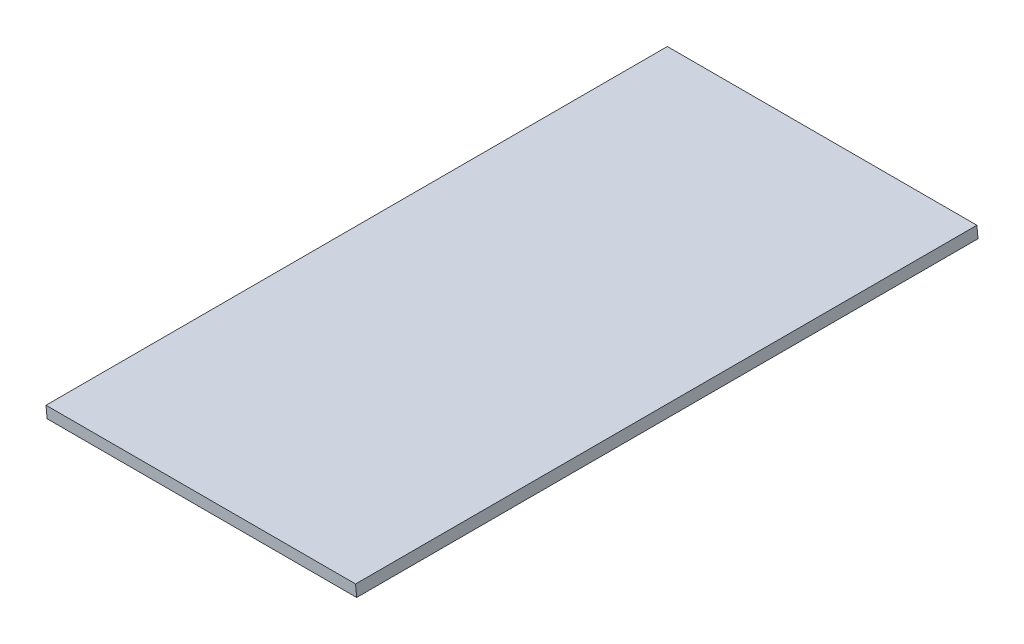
ISO-10303-21;
HEADER;
FILE_DESCRIPTION(('STEP AP214'),'2;1');
FILE_NAME('part.step','',(''),(''),'','','');
FILE_SCHEMA(('AUTOMOTIVE_DESIGN { 1 0 10303 214 1 1 1 1 }'));
ENDSEC;
DATA;
#1=APPLICATION_CONTEXT('core data for automotive mechanical design processes');
#2=APPLICATION_PROTOCOL_DEFINITION('international standard','automotive_design',2000,#1);
#3=PRODUCT_CONTEXT('',#1,'mechanical');
#4=PRODUCT('Part','Part','',(#3));
#5=PRODUCT_RELATED_PRODUCT_CATEGORY('part','',(#4));
#6=PRODUCT_DEFINITION_FORMATION('','',#4);
#7=PRODUCT_DEFINITION_CONTEXT('part definition',#1,'design');
#8=PRODUCT_DEFINITION('design','',#6,#7);
#9=PRODUCT_DEFINITION_SHAPE('','',#8);
#10=(LENGTH_UNIT() NAMED_UNIT(*) SI_UNIT(.MILLI.,.METRE.));
#11=(NAMED_UNIT(*) PLANE_ANGLE_UNIT() SI_UNIT($,.RADIAN.));
#12=(NAMED_UNIT(*) SI_UNIT($,.STERADIAN.) SOLID_ANGLE_UNIT());
#13=UNCERTAINTY_MEASURE_WITH_UNIT(LENGTH_MEASURE(1.E-05),#10,'distance_accuracy_value','');
#14=(GEOMETRIC_REPRESENTATION_CONTEXT(3) GLOBAL_UNCERTAINTY_ASSIGNED_CONTEXT((#13)) GLOBAL_UNIT_ASSIGNED_CONTEXT((#10,
#11,#12)) REPRESENTATION_CONTEXT('',''));
#15=CARTESIAN_POINT('',(0.,0.,0.));
#16=DIRECTION('',(0.,0.,1.));
#17=DIRECTION('',(1.,0.,0.));
#18=AXIS2_PLACEMENT_3D('',#15,#16,#17);
#19=CARTESIAN_POINT('',(-248.219224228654,-8.99999999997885,1000.));
#20=DIRECTION('',(0.995141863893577,0.0984513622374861,0.));
#21=DIRECTION('',(-0.0984513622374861,0.995141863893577,0.));
#22=AXIS2_PLACEMENT_3D('',#19,#20,#21);
#23=PLANE('',#22);
#24=DIRECTION('',(0.0984513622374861,-0.995141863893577,0.));
#25=VECTOR('',#24,1.);
#26=CARTESIAN_POINT('',(-248.219224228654,-8.99999999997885,0.));
#27=LINE('',#26,#25);
#28=CARTESIAN_POINT('',(-249.999999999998,8.99999999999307,0.));
#29=VERTEX_POINT('',#28);
#30=CARTESIAN_POINT('',(-248.219224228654,-8.99999999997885,0.));
#31=VERTEX_POINT('',#30);
#32=EDGE_CURVE('E96',#29,#31,#27,.T.);
#33=ORIENTED_EDGE('',*,*,#32,.T.);
#34=DIRECTION('',(0.,0.,-1.));
#35=VECTOR('',#34,1.);
#36=CARTESIAN_POINT('',(-248.219224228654,-8.99999999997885,1000.));
#37=LINE('',#36,#35);
#38=CARTESIAN_POINT('',(-248.219224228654,-8.99999999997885,1000.));
#39=VERTEX_POINT('',#38);
#40=EDGE_CURVE('E11',#39,#31,#37,.T.);
#41=ORIENTED_EDGE('',*,*,#40,.F.);
#42=DIRECTION('',(0.0984513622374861,-0.995141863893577,0.));
#43=VECTOR('',#42,1.);
#44=CARTESIAN_POINT('',(-248.219224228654,-8.99999999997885,1000.));
#45=LINE('',#44,#43);
#46=CARTESIAN_POINT('',(-249.999999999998,8.99999999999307,1000.));
#47=VERTEX_POINT('',#46);
#48=EDGE_CURVE('E84',#47,#39,#45,.T.);
#49=ORIENTED_EDGE('',*,*,#48,.F.);
#50=DIRECTION('',(0.,0.,-1.));
#51=VECTOR('',#50,1.);
#52=CARTESIAN_POINT('',(-249.999999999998,8.99999999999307,1000.));
#53=LINE('',#52,#51);
#54=EDGE_CURVE('E92',#47,#29,#53,.T.);
#55=ORIENTED_EDGE('',*,*,#54,.T.);
#56=EDGE_LOOP('',(#33,#41,#49,#55));
#57=FACE_BOUND('',#56,.T.);
#58=ADVANCED_FACE('F33',(#57),#23,.F.);
#59=CARTESIAN_POINT('',(250.000000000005,-8.99999999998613,1000.));
#60=DIRECTION('',(0.,1.,0.));
#61=DIRECTION('',(-1.,0.,0.));
#62=AXIS2_PLACEMENT_3D('',#59,#60,#61);
#63=PLANE('',#62);
#64=DIRECTION('',(1.,0.,0.));
#65=VECTOR('',#64,1.);
#66=CARTESIAN_POINT('',(250.000000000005,-8.99999999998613,0.));
#67=LINE('',#66,#65);
#68=CARTESIAN_POINT('',(250.000000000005,-8.99999999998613,0.));
#69=VERTEX_POINT('',#68);
#70=EDGE_CURVE('E88',#31,#69,#67,.T.);
#71=ORIENTED_EDGE('',*,*,#70,.T.);
#72=DIRECTION('',(0.,0.,-1.));
#73=VECTOR('',#72,1.);
#74=CARTESIAN_POINT('',(250.000000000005,-8.99999999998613,1000.));
#75=LINE('',#74,#73);
#76=CARTESIAN_POINT('',(250.000000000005,-8.99999999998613,1000.));
#77=VERTEX_POINT('',#76);
#78=EDGE_CURVE('E41',#77,#69,#75,.T.);
#79=ORIENTED_EDGE('',*,*,#78,.F.);
#80=DIRECTION('',(1.,0.,0.));
#81=VECTOR('',#80,1.);
#82=CARTESIAN_POINT('',(250.000000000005,-8.99999999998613,1000.));
#83=LINE('',#82,#81);
#84=EDGE_CURVE('E79',#39,#77,#83,.T.);
#85=ORIENTED_EDGE('',*,*,#84,.F.);
#86=ORIENTED_EDGE('',*,*,#40,.T.);
#87=EDGE_LOOP('',(#71,#79,#85,#86));
#88=FACE_BOUND('',#87,.T.);
#89=ADVANCED_FACE('F87',(#88),#63,.F.);
#90=CARTESIAN_POINT('',(248.219224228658,8.99999999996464,1000.));
#91=DIRECTION('',(-0.995141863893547,-0.0984513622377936,0.));
#92=DIRECTION('',(0.0984513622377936,-0.995141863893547,0.));
#93=AXIS2_PLACEMENT_3D('',#90,#91,#92);
#94=PLANE('',#93);
#95=DIRECTION('',(-0.0984513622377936,0.995141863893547,0.));
#96=VECTOR('',#95,1.);
#97=CARTESIAN_POINT('',(248.219224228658,8.99999999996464,0.));
#98=LINE('',#97,#96);
#99=CARTESIAN_POINT('',(248.219224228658,8.99999999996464,0.));
#100=VERTEX_POINT('',#99);
#101=EDGE_CURVE('E66',#69,#100,#98,.T.);
#102=ORIENTED_EDGE('',*,*,#101,.T.);
#103=DIRECTION('',(0.,0.,-1.));
#104=VECTOR('',#103,1.);
#105=CARTESIAN_POINT('',(248.219224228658,8.99999999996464,1000.));
#106=LINE('',#105,#104);
#107=CARTESIAN_POINT('',(248.219224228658,8.99999999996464,1000.));
#108=VERTEX_POINT('',#107);
#109=EDGE_CURVE('E89',#108,#100,#106,.T.);
#110=ORIENTED_EDGE('',*,*,#109,.F.);
#111=DIRECTION('',(-0.0984513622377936,0.995141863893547,0.));
#112=VECTOR('',#111,1.);
#113=CARTESIAN_POINT('',(248.219224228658,8.99999999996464,1000.));
#114=LINE('',#113,#112);
#115=EDGE_CURVE('E82',#77,#108,#114,.T.);
#116=ORIENTED_EDGE('',*,*,#115,.F.);
#117=ORIENTED_EDGE('',*,*,#78,.T.);
#118=EDGE_LOOP('',(#102,#110,#116,#117));
#119=FACE_BOUND('',#118,.T.);
#120=ADVANCED_FACE('F90',(#119),#94,.F.);
#121=CARTESIAN_POINT('',(-249.999999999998,8.99999999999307,1000.));
#122=DIRECTION('',(0.,-1.,0.));
#123=DIRECTION('',(1.,0.,0.));
#124=AXIS2_PLACEMENT_3D('',#121,#122,#123);
#125=PLANE('',#124);
#126=DIRECTION('',(-1.,0.,0.));
#127=VECTOR('',#126,1.);
#128=CARTESIAN_POINT('',(-249.999999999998,8.99999999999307,0.));
#129=LINE('',#128,#127);
#130=EDGE_CURVE('E72',#100,#29,#129,.T.);
#131=ORIENTED_EDGE('',*,*,#130,.T.);
#132=ORIENTED_EDGE('',*,*,#54,.F.);
#133=DIRECTION('',(-1.,0.,0.));
#134=VECTOR('',#133,1.);
#135=CARTESIAN_POINT('',(-249.999999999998,8.99999999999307,1000.));
#136=LINE('',#135,#134);
#137=EDGE_CURVE('E49',#108,#47,#136,.T.);
#138=ORIENTED_EDGE('',*,*,#137,.F.);
#139=ORIENTED_EDGE('',*,*,#109,.T.);
#140=EDGE_LOOP('',(#131,#132,#138,#139));
#141=FACE_BOUND('',#140,.T.);
#142=ADVANCED_FACE('F103',(#141),#125,.F.);
#143=CARTESIAN_POINT('',(0.,0.,1000.));
#144=DIRECTION('',(0.,0.,-1.));
#145=DIRECTION('',(-1.,0.,0.));
#146=AXIS2_PLACEMENT_3D('',#143,#144,#145);
#147=PLANE('',#146);
#148=ORIENTED_EDGE('',*,*,#48,.T.);
#149=ORIENTED_EDGE('',*,*,#84,.T.);
#150=ORIENTED_EDGE('',*,*,#115,.T.);
#151=ORIENTED_EDGE('',*,*,#137,.T.);
#152=EDGE_LOOP('',(#148,#149,#150,#151));
#153=FACE_BOUND('',#152,.T.);
#154=ADVANCED_FACE('F80',(#153),#147,.F.);
#155=CARTESIAN_POINT('',(0.,0.,0.));
#156=DIRECTION('',(0.,0.,-1.));
#157=DIRECTION('',(-1.,0.,0.));
#158=AXIS2_PLACEMENT_3D('',#155,#156,#157);
#159=PLANE('',#158);
#160=ORIENTED_EDGE('',*,*,#32,.F.);
#161=ORIENTED_EDGE('',*,*,#130,.F.);
#162=ORIENTED_EDGE('',*,*,#101,.F.);
#163=ORIENTED_EDGE('',*,*,#70,.F.);
#164=EDGE_LOOP('',(#160,#161,#162,#163));
#165=FACE_BOUND('',#164,.T.);
#166=ADVANCED_FACE('F106',(#165),#159,.T.);
#167=CLOSED_SHELL('',(#58,#89,#120,#142,#154,#166));
#168=MANIFOLD_SOLID_BREP('B2',#167);
#169=ADVANCED_BREP_SHAPE_REPRESENTATION('',(#18,#168),#14);
#170=SHAPE_DEFINITION_REPRESENTATION(#9,#169);
ENDSEC;
END-ISO-10303-21;
